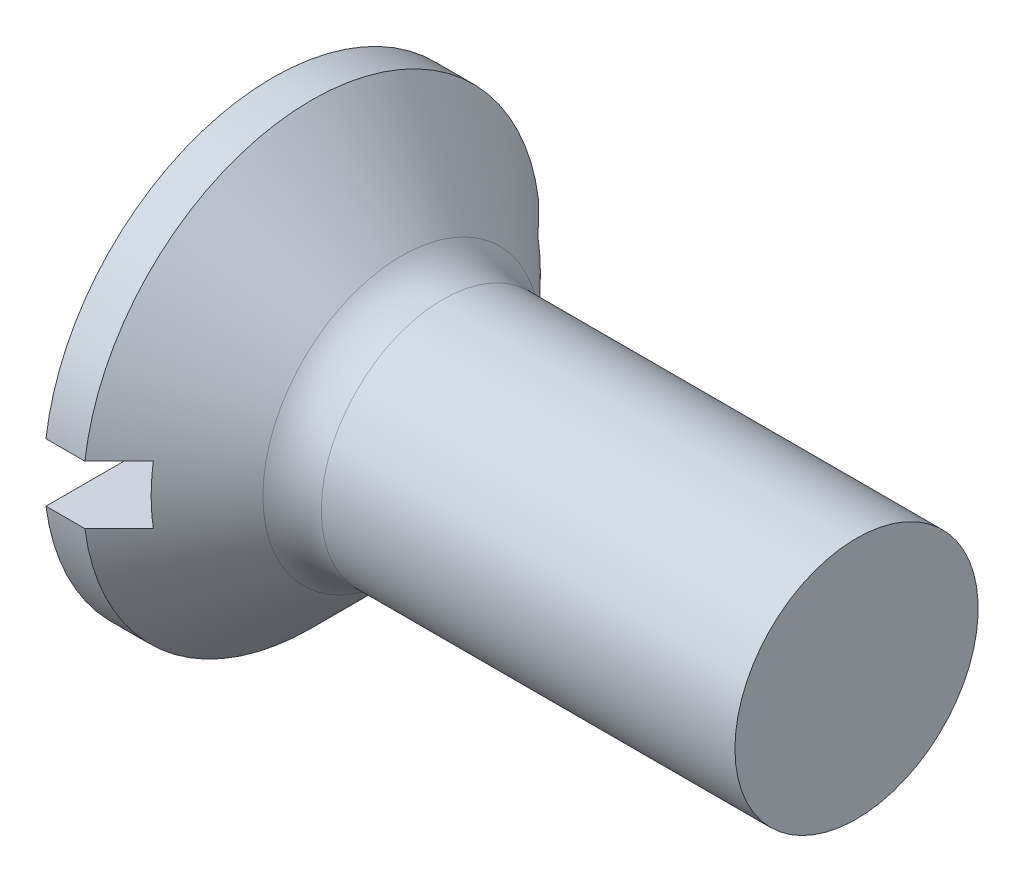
ISO-10303-21;
HEADER;
FILE_DESCRIPTION(('STEP AP214'),'2;1');
FILE_NAME('part.step','',(''),(''),'','','');
FILE_SCHEMA(('AUTOMOTIVE_DESIGN { 1 0 10303 214 1 1 1 1 }'));
ENDSEC;
DATA;
#1=APPLICATION_CONTEXT('core data for automotive mechanical design processes');
#2=APPLICATION_PROTOCOL_DEFINITION('international standard','automotive_design',2000,#1);
#3=PRODUCT_CONTEXT('',#1,'mechanical');
#4=PRODUCT('Part','Part','',(#3));
#5=PRODUCT_RELATED_PRODUCT_CATEGORY('part','',(#4));
#6=PRODUCT_DEFINITION_FORMATION('','',#4);
#7=PRODUCT_DEFINITION_CONTEXT('part definition',#1,'design');
#8=PRODUCT_DEFINITION('design','',#6,#7);
#9=PRODUCT_DEFINITION_SHAPE('','',#8);
#10=(LENGTH_UNIT() NAMED_UNIT(*) SI_UNIT(.MILLI.,.METRE.));
#11=(NAMED_UNIT(*) PLANE_ANGLE_UNIT() SI_UNIT($,.RADIAN.));
#12=(NAMED_UNIT(*) SI_UNIT($,.STERADIAN.) SOLID_ANGLE_UNIT());
#13=UNCERTAINTY_MEASURE_WITH_UNIT(LENGTH_MEASURE(1.E-05),#10,'distance_accuracy_value','');
#14=(GEOMETRIC_REPRESENTATION_CONTEXT(3) GLOBAL_UNCERTAINTY_ASSIGNED_CONTEXT((#13)) GLOBAL_UNIT_ASSIGNED_CONTEXT((#10,
#11,#12)) REPRESENTATION_CONTEXT('',''));
#15=CARTESIAN_POINT('',(0.,0.,0.));
#16=DIRECTION('',(0.,0.,1.));
#17=DIRECTION('',(1.,0.,0.));
#18=AXIS2_PLACEMENT_3D('',#15,#16,#17);
#19=CARTESIAN_POINT('',(0.,0.,0.));
#20=DIRECTION('',(-1.,0.,0.));
#21=DIRECTION('',(0.,0.,1.));
#22=AXIS2_PLACEMENT_3D('',#19,#20,#21);
#23=PLANE('',#22);
#24=DIRECTION('',(0.,0.,-1.));
#25=VECTOR('',#24,1.);
#26=CARTESIAN_POINT('',(0.,0.3,2.35));
#27=LINE('',#26,#25);
#28=CARTESIAN_POINT('',(0.,0.3,2.33077240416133));
#29=VERTEX_POINT('',#28);
#30=CARTESIAN_POINT('',(0.,0.3,-2.33077240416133));
#31=VERTEX_POINT('',#30);
#32=EDGE_CURVE('E167',#29,#31,#27,.T.);
#33=ORIENTED_EDGE('',*,*,#32,.F.);
#34=CARTESIAN_POINT('',(0.,0.,0.));
#35=DIRECTION('',(-1.,0.,0.));
#36=DIRECTION('',(0.,0.,1.));
#37=AXIS2_PLACEMENT_3D('',#34,#35,#36);
#38=CIRCLE('',#37,2.35);
#39=EDGE_CURVE('E109',#29,#31,#38,.T.);
#40=ORIENTED_EDGE('',*,*,#39,.T.);
#41=EDGE_LOOP('',(#33,#40));
#42=FACE_BOUND('',#41,.T.);
#43=ADVANCED_FACE('F28',(#42),#23,.T.);
#44=CARTESIAN_POINT('',(-6.34999999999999,0.,0.));
#45=DIRECTION('',(-1.,0.,0.));
#46=DIRECTION('',(0.,0.,1.));
#47=AXIS2_PLACEMENT_3D('',#44,#45,#46);
#48=CYLINDRICAL_SURFACE('',#47,2.35);
#49=DIRECTION('',(-1.,0.,0.));
#50=VECTOR('',#49,1.);
#51=CARTESIAN_POINT('',(-6.34999999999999,0.3,-2.33077240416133));
#52=LINE('',#51,#50);
#53=CARTESIAN_POINT('',(0.399999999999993,0.3,-2.33077240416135));
#54=VERTEX_POINT('',#53);
#55=EDGE_CURVE('E56',#31,#54,#52,.F.);
#56=ORIENTED_EDGE('',*,*,#55,.F.);
#57=ORIENTED_EDGE('',*,*,#39,.F.);
#58=DIRECTION('',(-1.,0.,0.));
#59=VECTOR('',#58,1.);
#60=CARTESIAN_POINT('',(-6.34999999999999,0.3,2.33077240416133));
#61=LINE('',#60,#59);
#62=CARTESIAN_POINT('',(0.400000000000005,0.3,2.33077240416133));
#63=VERTEX_POINT('',#62);
#64=EDGE_CURVE('E173',#63,#29,#61,.T.);
#65=ORIENTED_EDGE('',*,*,#64,.F.);
#66=CARTESIAN_POINT('',(0.400000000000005,0.,0.));
#67=DIRECTION('',(-1.,0.,0.));
#68=DIRECTION('',(0.,0.,1.));
#69=AXIS2_PLACEMENT_3D('',#66,#67,#68);
#70=CIRCLE('',#69,2.35);
#71=EDGE_CURVE('E103',#63,#54,#70,.T.);
#72=ORIENTED_EDGE('',*,*,#71,.T.);
#73=EDGE_LOOP('',(#56,#57,#65,#72));
#74=FACE_BOUND('',#73,.T.);
#75=ADVANCED_FACE('F152',(#74),#48,.T.);
#76=DIRECTION('',(0.,0.,1.));
#77=VECTOR('',#76,1.);
#78=CARTESIAN_POINT('',(0.,-0.300000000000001,-2.35));
#79=LINE('',#78,#77);
#80=CARTESIAN_POINT('',(0.,-0.300000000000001,-2.33077240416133));
#81=VERTEX_POINT('',#80);
#82=CARTESIAN_POINT('',(0.,-0.300000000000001,2.33077240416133));
#83=VERTEX_POINT('',#82);
#84=EDGE_CURVE('E97',#81,#83,#79,.T.);
#85=ORIENTED_EDGE('',*,*,#84,.F.);
#86=EDGE_CURVE('E105',#81,#83,#38,.T.);
#87=ORIENTED_EDGE('',*,*,#86,.T.);
#88=EDGE_LOOP('',(#85,#87));
#89=FACE_BOUND('',#88,.T.);
#90=ADVANCED_FACE('F30',(#89),#23,.T.);
#91=DIRECTION('',(-1.,0.,0.));
#92=VECTOR('',#91,1.);
#93=CARTESIAN_POINT('',(-6.34999999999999,-0.300000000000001,2.33077240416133));
#94=LINE('',#93,#92);
#95=CARTESIAN_POINT('',(0.399999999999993,-0.300000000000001,2.33077240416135));
#96=VERTEX_POINT('',#95);
#97=EDGE_CURVE('E172',#83,#96,#94,.F.);
#98=ORIENTED_EDGE('',*,*,#97,.F.);
#99=ORIENTED_EDGE('',*,*,#86,.F.);
#100=DIRECTION('',(-1.,0.,0.));
#101=VECTOR('',#100,1.);
#102=CARTESIAN_POINT('',(-6.34999999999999,-0.300000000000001,-2.33077240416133));
#103=LINE('',#102,#101);
#104=CARTESIAN_POINT('',(0.400000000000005,-0.300000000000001,-2.33077240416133));
#105=VERTEX_POINT('',#104);
#106=EDGE_CURVE('E170',#105,#81,#103,.T.);
#107=ORIENTED_EDGE('',*,*,#106,.F.);
#108=EDGE_CURVE('E106',#105,#96,#70,.T.);
#109=ORIENTED_EDGE('',*,*,#108,.T.);
#110=EDGE_LOOP('',(#98,#99,#107,#109));
#111=FACE_BOUND('',#110,.T.);
#112=ADVANCED_FACE('F149',(#111),#48,.T.);
#113=CARTESIAN_POINT('',(0.400000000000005,0.,0.));
#114=DIRECTION('',(-1.,0.,0.));
#115=DIRECTION('',(0.,0.,1.));
#116=AXIS2_PLACEMENT_3D('',#113,#114,#115);
#117=CONICAL_SURFACE('',#116,2.35,0.78539816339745);
#118=CARTESIAN_POINT('',(-2.42800833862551,0.299999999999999,-5.16931043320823));
#119=CARTESIAN_POINT('',(-2.25261841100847,0.299999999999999,-4.99362307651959));
#120=CARTESIAN_POINT('',(-2.07724133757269,0.299999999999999,-4.81792287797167));
#121=CARTESIAN_POINT('',(-1.72652707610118,0.299999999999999,-4.46647837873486));
#122=CARTESIAN_POINT('',(-1.55118988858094,0.299999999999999,-4.29073407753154));
#123=CARTESIAN_POINT('',(-1.20052586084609,0.299999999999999,-3.93913911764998));
#124=CARTESIAN_POINT('',(-1.02519903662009,0.299999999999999,-3.76328844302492));
#125=CARTESIAN_POINT('',(-0.674635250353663,0.299999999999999,-3.41150171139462));
#126=CARTESIAN_POINT('',(-0.499398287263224,0.299999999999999,-3.23556565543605));
#127=CARTESIAN_POINT('',(-0.14274224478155,0.3,-2.87719891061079));
#128=CARTESIAN_POINT('',(0.0386716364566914,0.3,-2.69476304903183));
#129=CARTESIAN_POINT('',(0.401243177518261,0.3,-2.32962368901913));
#130=CARTESIAN_POINT('',(0.582400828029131,0.3,-2.14692018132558));
#131=CARTESIAN_POINT('',(0.853701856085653,0.3,-1.87246633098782));
#132=CARTESIAN_POINT('',(0.944055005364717,0.3,-1.78092337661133));
#133=CARTESIAN_POINT('',(1.12454060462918,0.3,-1.59761714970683));
#134=CARTESIAN_POINT('',(1.21467305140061,0.3,-1.50585387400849));
#135=CARTESIAN_POINT('',(1.39455527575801,0.3,-1.32196522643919));
#136=CARTESIAN_POINT('',(1.48430507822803,0.3,-1.229839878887));
#137=CARTESIAN_POINT('',(1.66312457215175,0.3,-1.04493203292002));
#138=CARTESIAN_POINT('',(1.75219428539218,0.3,-0.952149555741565));
#139=CARTESIAN_POINT('',(1.86420471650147,0.3,-0.833484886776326));
#140=CARTESIAN_POINT('',(1.88787598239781,0.3,-0.808293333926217));
#141=CARTESIAN_POINT('',(1.93506265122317,0.3,-0.757763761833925));
#142=CARTESIAN_POINT('',(1.95857805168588,0.3,-0.732425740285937));
#143=CARTESIAN_POINT('',(2.00531964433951,0.3,-0.681650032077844));
#144=CARTESIAN_POINT('',(2.02854656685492,0.3,-0.656213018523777));
#145=CARTESIAN_POINT('',(2.07471756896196,0.3,-0.605084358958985));
#146=CARTESIAN_POINT('',(2.09766165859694,0.3,-0.579392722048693));
#147=CARTESIAN_POINT('',(2.15086468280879,0.3,-0.51888076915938));
#148=CARTESIAN_POINT('',(2.18096450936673,0.3,-0.48392043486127));
#149=CARTESIAN_POINT('',(2.24014710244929,0.3,-0.412740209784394));
#150=CARTESIAN_POINT('',(2.26922201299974,0.3,-0.376513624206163));
#151=CARTESIAN_POINT('',(2.31115781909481,0.3,-0.320521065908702));
#152=CARTESIAN_POINT('',(2.32494116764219,0.3,-0.301451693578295));
#153=CARTESIAN_POINT('',(2.35155128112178,0.3,-0.262609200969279));
#154=CARTESIAN_POINT('',(2.36437673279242,0.3,-0.242835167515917));
#155=CARTESIAN_POINT('',(2.38838369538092,0.3,-0.202548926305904));
#156=CARTESIAN_POINT('',(2.39957972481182,0.3,-0.182045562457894));
#157=CARTESIAN_POINT('',(2.41950326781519,0.3,-0.139898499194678));
#158=CARTESIAN_POINT('',(2.42823853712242,0.3,-0.118258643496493));
#159=CARTESIAN_POINT('',(2.44121464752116,0.3,-0.0756315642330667));
#160=CARTESIAN_POINT('',(2.44577820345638,0.3,-0.0547490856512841));
#161=CARTESIAN_POINT('',(2.45045814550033,0.3,-0.0125607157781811));
#162=CARTESIAN_POINT('',(2.45059819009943,0.3,0.00874231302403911));
#163=CARTESIAN_POINT('',(2.44645713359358,0.3,0.0507745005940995));
#164=CARTESIAN_POINT('',(2.44219645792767,0.3,0.0715058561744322));
#165=CARTESIAN_POINT('',(2.43034285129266,0.3,0.112088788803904));
#166=CARTESIAN_POINT('',(2.42272600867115,0.3,0.131932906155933));
#167=CARTESIAN_POINT('',(2.40627133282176,0.3,0.168480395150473));
#168=CARTESIAN_POINT('',(2.39765896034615,0.3,0.185289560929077));
#169=CARTESIAN_POINT('',(2.3792568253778,0.3,0.218258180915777));
#170=CARTESIAN_POINT('',(2.36946608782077,0.3,0.234417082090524));
#171=CARTESIAN_POINT('',(2.33884369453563,0.3,0.282238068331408));
#172=CARTESIAN_POINT('',(2.3168212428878,0.3,0.313127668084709));
#173=CARTESIAN_POINT('',(2.27098335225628,0.3,0.37396790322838));
#174=CARTESIAN_POINT('',(2.24715273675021,0.3,0.403906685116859));
#175=CARTESIAN_POINT('',(2.19860686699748,0.3,0.462939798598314));
#176=CARTESIAN_POINT('',(2.17389378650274,0.3,0.492035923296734));
#177=CARTESIAN_POINT('',(2.09996652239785,0.3,0.577366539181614));
#178=CARTESIAN_POINT('',(2.04995461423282,0.3,0.632904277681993));
#179=CARTESIAN_POINT('',(1.94893899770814,0.3,0.743075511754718));
#180=CARTESIAN_POINT('',(1.89793511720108,0.3,0.797708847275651));
#181=CARTESIAN_POINT('',(1.79530712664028,0.3,0.906513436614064));
#182=CARTESIAN_POINT('',(1.74368234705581,0.3,0.960684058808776));
#183=CARTESIAN_POINT('',(1.64009874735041,0.3,1.06869576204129));
#184=CARTESIAN_POINT('',(1.58813995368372,0.3,1.12253686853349));
#185=CARTESIAN_POINT('',(1.43299775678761,0.3,1.28265340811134));
#186=CARTESIAN_POINT('',(1.3294988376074,0.3,1.38862292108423));
#187=CARTESIAN_POINT('',(1.12213953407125,0.3,1.60010735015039));
#188=CARTESIAN_POINT('',(1.0182793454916,0.3,1.70562245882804));
#189=CARTESIAN_POINT('',(0.776938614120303,0.3,1.95025555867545));
#190=CARTESIAN_POINT('',(0.639369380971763,0.3,2.0892860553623));
#191=CARTESIAN_POINT('',(0.364008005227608,0.3,2.36712673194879));
#192=CARTESIAN_POINT('',(0.226215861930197,0.3,2.50593691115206));
#193=CARTESIAN_POINT('',(-0.187415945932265,0.3,2.92222808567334));
#194=CARTESIAN_POINT('',(-0.463453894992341,0.3,3.19951203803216));
#195=CARTESIAN_POINT('',(-1.02086601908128,0.3,3.7589880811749));
#196=CARTESIAN_POINT('',(-1.30224437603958,0.3,4.04117600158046));
#197=CARTESIAN_POINT('',(-1.86507745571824,0.3,4.60535323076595));
#198=CARTESIAN_POINT('',(-2.14653214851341,0.3,4.88734256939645));
#199=CARTESIAN_POINT('',(-2.42800833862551,0.3,5.16931043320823));
#200=B_SPLINE_CURVE_WITH_KNOTS('',3,(#118,#119,#120,#121,#122,#123,#124,#125,#126,#127,#128,
#129,#130,#131,#132,#133,#134,#135,#136,#137,#138,#139,#140,#141,#142,#143,#144,#145,#146,#147,
#148,#149,#150,#151,#152,#153,#154,#155,#156,#157,#158,#159,#160,#161,#162,#163,#164,#165,#166,
#167,#168,#169,#170,#171,#172,#173,#174,#175,#176,#177,#178,#179,#180,#181,#182,#183,#184,#185,
#186,#187,#188,#189,#190,#191,#192,#193,#194,#195,#196,#197,#198,#199),.UNSPECIFIED.,.F.,.F.,(4,
2,2,2,2,2,2,2,2,2,2,2,2,2,2,2,2,2,2,2,2,2,2,2,2,2,2,2,2,2,2,2,2,2,2,2,2,2,2,2,4),(0.,
0.744747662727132,1.48950445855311,2.23446524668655,2.97941712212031,3.75126198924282,
4.52313422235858,4.9090022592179,5.29487588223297,5.68072401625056,6.06655973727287,
6.17026308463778,6.27396806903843,6.37730491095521,6.48063807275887,6.61902727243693,
6.75831338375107,6.82888195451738,6.89954556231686,6.96953490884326,7.03930113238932,
7.10304879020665,7.16645544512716,7.22956912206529,7.29313992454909,7.34974016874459,
7.40638757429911,7.52007317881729,7.63484962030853,7.74936057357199,7.97354071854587,
8.19776012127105,8.42224800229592,8.64671831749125,9.09109579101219,9.53526148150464,
10.1220256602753,10.7087916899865,11.8825672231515,13.078073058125,14.2733188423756),.UNSPECIFIED.);
#201=CARTESIAN_POINT('',(0.75,0.3,1.97737199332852));
#202=VERTEX_POINT('',#201);
#203=EDGE_CURVE('E11',#202,#63,#200,.T.);
#204=ORIENTED_EDGE('',*,*,#203,.F.);
#205=CARTESIAN_POINT('',(0.75,0.,0.));
#206=DIRECTION('',(1.,0.,0.));
#207=DIRECTION('',(0.,0.,-1.));
#208=AXIS2_PLACEMENT_3D('',#205,#206,#207);
#209=CIRCLE('',#208,2.);
#210=CARTESIAN_POINT('',(0.75,-0.300000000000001,1.97737199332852));
#211=VERTEX_POINT('',#210);
#212=EDGE_CURVE('E85',#211,#202,#209,.F.);
#213=ORIENTED_EDGE('',*,*,#212,.F.);
#214=CARTESIAN_POINT('',(-2.42800833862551,-0.300000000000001,5.16931043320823));
#215=CARTESIAN_POINT('',(-2.25261841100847,-0.300000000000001,4.99362307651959));
#216=CARTESIAN_POINT('',(-2.07724133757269,-0.300000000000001,4.81792287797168));
#217=CARTESIAN_POINT('',(-1.72652707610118,-0.300000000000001,4.46647837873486));
#218=CARTESIAN_POINT('',(-1.55118988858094,-0.300000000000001,4.29073407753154));
#219=CARTESIAN_POINT('',(-1.20052586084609,-0.300000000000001,3.93913911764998));
#220=CARTESIAN_POINT('',(-1.02519903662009,-0.300000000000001,3.76328844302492));
#221=CARTESIAN_POINT('',(-0.674635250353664,-0.300000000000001,3.41150171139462));
#222=CARTESIAN_POINT('',(-0.499398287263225,-0.300000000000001,3.23556565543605));
#223=CARTESIAN_POINT('',(-0.142742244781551,-0.300000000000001,2.87719891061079));
#224=CARTESIAN_POINT('',(0.0386716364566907,-0.300000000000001,2.69476304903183));
#225=CARTESIAN_POINT('',(0.401243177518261,-0.300000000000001,2.32962368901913));
#226=CARTESIAN_POINT('',(0.58240082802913,-0.300000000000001,2.14692018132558));
#227=CARTESIAN_POINT('',(0.853701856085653,-0.300000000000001,1.87246633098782));
#228=CARTESIAN_POINT('',(0.944055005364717,-0.300000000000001,1.78092337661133));
#229=CARTESIAN_POINT('',(1.12454060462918,-0.300000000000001,1.59761714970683));
#230=CARTESIAN_POINT('',(1.21467305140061,-0.300000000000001,1.50585387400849));
#231=CARTESIAN_POINT('',(1.39455527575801,-0.300000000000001,1.32196522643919));
#232=CARTESIAN_POINT('',(1.48430507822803,-0.300000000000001,1.229839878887));
#233=CARTESIAN_POINT('',(1.66312457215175,-0.300000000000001,1.04493203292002));
#234=CARTESIAN_POINT('',(1.75219428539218,-0.300000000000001,0.952149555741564));
#235=CARTESIAN_POINT('',(1.86420471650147,-0.300000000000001,0.833484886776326));
#236=CARTESIAN_POINT('',(1.88787598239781,-0.300000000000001,0.808293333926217));
#237=CARTESIAN_POINT('',(1.93506265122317,-0.300000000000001,0.757763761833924));
#238=CARTESIAN_POINT('',(1.95857805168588,-0.300000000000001,0.732425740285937));
#239=CARTESIAN_POINT('',(2.00531964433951,-0.300000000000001,0.681650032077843));
#240=CARTESIAN_POINT('',(2.02854656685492,-0.300000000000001,0.656213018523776));
#241=CARTESIAN_POINT('',(2.07471756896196,-0.300000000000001,0.605084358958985));
#242=CARTESIAN_POINT('',(2.09766165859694,-0.300000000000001,0.579392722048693));
#243=CARTESIAN_POINT('',(2.15086468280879,-0.300000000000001,0.51888076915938));
#244=CARTESIAN_POINT('',(2.18096450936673,-0.300000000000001,0.48392043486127));
#245=CARTESIAN_POINT('',(2.24014710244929,-0.300000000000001,0.412740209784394));
#246=CARTESIAN_POINT('',(2.26922201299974,-0.300000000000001,0.376513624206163));
#247=CARTESIAN_POINT('',(2.31115781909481,-0.300000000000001,0.320521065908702));
#248=CARTESIAN_POINT('',(2.32494116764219,-0.300000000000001,0.301451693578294));
#249=CARTESIAN_POINT('',(2.35155128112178,-0.300000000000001,0.262609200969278));
#250=CARTESIAN_POINT('',(2.36437673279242,-0.300000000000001,0.242835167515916));
#251=CARTESIAN_POINT('',(2.38838369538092,-0.300000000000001,0.202548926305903));
#252=CARTESIAN_POINT('',(2.39957972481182,-0.300000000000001,0.182045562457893));
#253=CARTESIAN_POINT('',(2.41950326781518,-0.300000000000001,0.139898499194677));
#254=CARTESIAN_POINT('',(2.42823853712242,-0.300000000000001,0.118258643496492));
#255=CARTESIAN_POINT('',(2.44121464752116,-0.300000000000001,0.075631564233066));
#256=CARTESIAN_POINT('',(2.44577820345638,-0.300000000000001,0.0547490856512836));
#257=CARTESIAN_POINT('',(2.45045814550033,-0.300000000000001,0.0125607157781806));
#258=CARTESIAN_POINT('',(2.45059819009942,-0.300000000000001,-0.00874231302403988));
#259=CARTESIAN_POINT('',(2.44645713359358,-0.300000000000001,-0.0507745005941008));
#260=CARTESIAN_POINT('',(2.44219645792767,-0.300000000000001,-0.0715058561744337));
#261=CARTESIAN_POINT('',(2.43034285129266,-0.300000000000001,-0.112088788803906));
#262=CARTESIAN_POINT('',(2.42272600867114,-0.300000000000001,-0.131932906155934));
#263=CARTESIAN_POINT('',(2.40627133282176,-0.300000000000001,-0.168480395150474));
#264=CARTESIAN_POINT('',(2.39765896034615,-0.300000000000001,-0.185289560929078));
#265=CARTESIAN_POINT('',(2.3792568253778,-0.300000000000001,-0.21825818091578));
#266=CARTESIAN_POINT('',(2.36946608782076,-0.300000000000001,-0.234417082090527));
#267=CARTESIAN_POINT('',(2.33884369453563,-0.300000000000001,-0.28223806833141));
#268=CARTESIAN_POINT('',(2.3168212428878,-0.300000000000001,-0.313127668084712));
#269=CARTESIAN_POINT('',(2.27098335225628,-0.300000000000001,-0.373967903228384));
#270=CARTESIAN_POINT('',(2.2471527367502,-0.300000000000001,-0.403906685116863));
#271=CARTESIAN_POINT('',(2.19860686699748,-0.300000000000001,-0.462939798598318));
#272=CARTESIAN_POINT('',(2.17389378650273,-0.300000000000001,-0.492035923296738));
#273=CARTESIAN_POINT('',(2.09996652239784,-0.300000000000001,-0.577366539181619));
#274=CARTESIAN_POINT('',(2.04995461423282,-0.300000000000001,-0.632904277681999));
#275=CARTESIAN_POINT('',(1.94893899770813,-0.300000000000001,-0.743075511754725));
#276=CARTESIAN_POINT('',(1.89793511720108,-0.300000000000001,-0.797708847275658));
#277=CARTESIAN_POINT('',(1.79530712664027,-0.300000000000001,-0.906513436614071));
#278=CARTESIAN_POINT('',(1.74368234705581,-0.300000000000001,-0.960684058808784));
#279=CARTESIAN_POINT('',(1.64009874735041,-0.300000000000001,-1.0686957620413));
#280=CARTESIAN_POINT('',(1.58813995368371,-0.300000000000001,-1.1225368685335));
#281=CARTESIAN_POINT('',(1.4329977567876,-0.300000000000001,-1.28265340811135));
#282=CARTESIAN_POINT('',(1.32949883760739,-0.300000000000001,-1.38862292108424));
#283=CARTESIAN_POINT('',(1.12213953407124,-0.300000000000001,-1.60010735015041));
#284=CARTESIAN_POINT('',(1.01827934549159,-0.300000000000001,-1.70562245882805));
#285=CARTESIAN_POINT('',(0.776938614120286,-0.300000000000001,-1.95025555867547));
#286=CARTESIAN_POINT('',(0.639369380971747,-0.300000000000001,-2.08928605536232));
#287=CARTESIAN_POINT('',(0.364008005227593,-0.300000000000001,-2.36712673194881));
#288=CARTESIAN_POINT('',(0.226215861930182,-0.300000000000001,-2.50593691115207));
#289=CARTESIAN_POINT('',(-0.187415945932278,-0.300000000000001,-2.92222808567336));
#290=CARTESIAN_POINT('',(-0.463453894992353,-0.300000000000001,-3.19951203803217));
#291=CARTESIAN_POINT('',(-1.02086601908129,-0.300000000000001,-3.75898808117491));
#292=CARTESIAN_POINT('',(-1.30224437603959,-0.300000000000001,-4.04117600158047));
#293=CARTESIAN_POINT('',(-1.86507745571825,-0.300000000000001,-4.60535323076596));
#294=CARTESIAN_POINT('',(-2.14653214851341,-0.300000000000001,-4.88734256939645));
#295=CARTESIAN_POINT('',(-2.42800833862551,-0.300000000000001,-5.16931043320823));
#296=B_SPLINE_CURVE_WITH_KNOTS('',3,(#214,#215,#216,#217,#218,#219,#220,#221,#222,#223,#224,
#225,#226,#227,#228,#229,#230,#231,#232,#233,#234,#235,#236,#237,#238,#239,#240,#241,#242,#243,
#244,#245,#246,#247,#248,#249,#250,#251,#252,#253,#254,#255,#256,#257,#258,#259,#260,#261,#262,
#263,#264,#265,#266,#267,#268,#269,#270,#271,#272,#273,#274,#275,#276,#277,#278,#279,#280,#281,
#282,#283,#284,#285,#286,#287,#288,#289,#290,#291,#292,#293,#294,#295),.UNSPECIFIED.,.F.,.F.,(4,
2,2,2,2,2,2,2,2,2,2,2,2,2,2,2,2,2,2,2,2,2,2,2,2,2,2,2,2,2,2,2,2,2,2,2,2,2,2,2,4),(0.,
0.744747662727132,1.48950445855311,2.23446524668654,2.97941712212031,3.75126198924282,
4.52313422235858,4.9090022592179,5.29487588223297,5.68072401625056,6.06655973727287,
6.17026308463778,6.27396806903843,6.37730491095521,6.48063807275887,6.61902727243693,
6.75831338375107,6.82888195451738,6.89954556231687,6.96953490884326,7.03930113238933,
7.10304879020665,7.16645544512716,7.22956912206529,7.29313992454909,7.3497401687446,
7.40638757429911,7.5200731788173,7.63484962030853,7.74936057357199,7.97354071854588,
8.19776012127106,8.42224800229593,8.64671831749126,9.0910957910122,9.53526148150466,
10.1220256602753,10.7087916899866,11.8825672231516,13.078073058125,14.2733188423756),.UNSPECIFIED.);
#297=EDGE_CURVE('E42',#96,#211,#296,.T.);
#298=ORIENTED_EDGE('',*,*,#297,.F.);
#299=ORIENTED_EDGE('',*,*,#108,.F.);
#300=CARTESIAN_POINT('',(0.75,-0.300000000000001,-1.97737199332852));
#301=VERTEX_POINT('',#300);
#302=EDGE_CURVE('E121',#301,#105,#296,.T.);
#303=ORIENTED_EDGE('',*,*,#302,.F.);
#304=CARTESIAN_POINT('',(0.75,0.3,-1.97737199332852));
#305=VERTEX_POINT('',#304);
#306=EDGE_CURVE('E93',#305,#301,#209,.F.);
#307=ORIENTED_EDGE('',*,*,#306,.F.);
#308=EDGE_CURVE('E32',#54,#305,#200,.T.);
#309=ORIENTED_EDGE('',*,*,#308,.F.);
#310=ORIENTED_EDGE('',*,*,#71,.F.);
#311=EDGE_LOOP('',(#204,#213,#298,#299,#303,#307,#309,#310));
#312=FACE_BOUND('',#311,.T.);
#313=CARTESIAN_POINT('',(1.32426406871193,0.,0.));
#314=DIRECTION('',(-1.,0.,0.));
#315=DIRECTION('',(0.,0.,1.));
#316=AXIS2_PLACEMENT_3D('',#313,#314,#315);
#317=CIRCLE('',#316,1.42573593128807);
#318=CARTESIAN_POINT('',(1.32426406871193,0.,1.42573593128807));
#319=VERTEX_POINT('',#318);
#320=EDGE_CURVE('E116',#319,#319,#317,.T.);
#321=ORIENTED_EDGE('',*,*,#320,.T.);
#322=EDGE_LOOP('',(#321));
#323=FACE_BOUND('',#322,.T.);
#324=ADVANCED_FACE('F100',(#312,#323),#117,.T.);
#325=CARTESIAN_POINT('',(-6.34999999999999,0.,0.));
#326=DIRECTION('',(-1.,0.,0.));
#327=DIRECTION('',(0.,0.,1.));
#328=AXIS2_PLACEMENT_3D('',#325,#326,#327);
#329=CYLINDRICAL_SURFACE('',#328,1.25);
#330=CARTESIAN_POINT('',(1.74852813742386,0.,0.));
#331=DIRECTION('',(-1.,0.,0.));
#332=DIRECTION('',(0.,0.,1.));
#333=AXIS2_PLACEMENT_3D('',#330,#331,#332);
#334=CIRCLE('',#333,1.25);
#335=CARTESIAN_POINT('',(1.74852813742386,0.,1.25));
#336=VERTEX_POINT('',#335);
#337=EDGE_CURVE('E119',#336,#336,#334,.F.);
#338=ORIENTED_EDGE('',*,*,#337,.T.);
#339=EDGE_LOOP('',(#338));
#340=FACE_BOUND('',#339,.T.);
#341=CARTESIAN_POINT('',(6.,0.,0.));
#342=DIRECTION('',(-1.,0.,0.));
#343=DIRECTION('',(0.,0.,1.));
#344=AXIS2_PLACEMENT_3D('',#341,#342,#343);
#345=CIRCLE('',#344,1.25);
#346=CARTESIAN_POINT('',(6.,0.,1.25));
#347=VERTEX_POINT('',#346);
#348=EDGE_CURVE('E112',#347,#347,#345,.T.);
#349=ORIENTED_EDGE('',*,*,#348,.T.);
#350=EDGE_LOOP('',(#349));
#351=FACE_BOUND('',#350,.T.);
#352=ADVANCED_FACE('F142',(#340,#351),#329,.T.);
#353=CARTESIAN_POINT('',(6.,1.25,0.));
#354=DIRECTION('',(1.,0.,0.));
#355=DIRECTION('',(0.,0.,-1.));
#356=AXIS2_PLACEMENT_3D('',#353,#354,#355);
#357=PLANE('',#356);
#358=ORIENTED_EDGE('',*,*,#348,.F.);
#359=EDGE_LOOP('',(#358));
#360=FACE_BOUND('',#359,.T.);
#361=ADVANCED_FACE('F139',(#360),#357,.T.);
#362=CARTESIAN_POINT('',(1.74852813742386,0.,0.));
#363=DIRECTION('',(-1.,0.,0.));
#364=DIRECTION('',(0.,0.,1.));
#365=AXIS2_PLACEMENT_3D('',#362,#363,#364);
#366=TOROIDAL_SURFACE('',#365,1.85,0.6);
#367=ORIENTED_EDGE('',*,*,#337,.F.);
#368=EDGE_LOOP('',(#367));
#369=FACE_BOUND('',#368,.T.);
#370=ORIENTED_EDGE('',*,*,#320,.F.);
#371=EDGE_LOOP('',(#370));
#372=FACE_BOUND('',#371,.T.);
#373=ADVANCED_FACE('F136',(#369,#372),#366,.F.);
#374=CARTESIAN_POINT('',(0.75,0.3,2.35));
#375=DIRECTION('',(0.,1.,0.));
#376=DIRECTION('',(0.,0.,1.));
#377=AXIS2_PLACEMENT_3D('',#374,#375,#376);
#378=PLANE('',#377);
#379=ORIENTED_EDGE('',*,*,#55,.T.);
#380=ORIENTED_EDGE('',*,*,#308,.T.);
#381=DIRECTION('',(0.,0.,-1.));
#382=VECTOR('',#381,1.);
#383=CARTESIAN_POINT('',(0.75,0.3,2.35));
#384=LINE('',#383,#382);
#385=EDGE_CURVE('E49',#202,#305,#384,.T.);
#386=ORIENTED_EDGE('',*,*,#385,.F.);
#387=ORIENTED_EDGE('',*,*,#203,.T.);
#388=ORIENTED_EDGE('',*,*,#64,.T.);
#389=ORIENTED_EDGE('',*,*,#32,.T.);
#390=EDGE_LOOP('',(#379,#380,#386,#387,#388,#389));
#391=FACE_BOUND('',#390,.T.);
#392=ADVANCED_FACE('F94',(#391),#378,.F.);
#393=CARTESIAN_POINT('',(0.75,-0.300000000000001,-2.35));
#394=DIRECTION('',(0.,-1.,0.));
#395=DIRECTION('',(0.,0.,-1.));
#396=AXIS2_PLACEMENT_3D('',#393,#394,#395);
#397=PLANE('',#396);
#398=ORIENTED_EDGE('',*,*,#97,.T.);
#399=ORIENTED_EDGE('',*,*,#297,.T.);
#400=DIRECTION('',(0.,0.,1.));
#401=VECTOR('',#400,1.);
#402=CARTESIAN_POINT('',(0.75,-0.300000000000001,-2.35));
#403=LINE('',#402,#401);
#404=EDGE_CURVE('E88',#301,#211,#403,.T.);
#405=ORIENTED_EDGE('',*,*,#404,.F.);
#406=ORIENTED_EDGE('',*,*,#302,.T.);
#407=ORIENTED_EDGE('',*,*,#106,.T.);
#408=ORIENTED_EDGE('',*,*,#84,.T.);
#409=EDGE_LOOP('',(#398,#399,#405,#406,#407,#408));
#410=FACE_BOUND('',#409,.T.);
#411=ADVANCED_FACE('F128',(#410),#397,.F.);
#412=CARTESIAN_POINT('',(0.75,-0.300000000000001,-2.35));
#413=DIRECTION('',(1.,0.,0.));
#414=DIRECTION('',(0.,0.,-1.));
#415=AXIS2_PLACEMENT_3D('',#412,#413,#414);
#416=PLANE('',#415);
#417=ORIENTED_EDGE('',*,*,#212,.T.);
#418=ORIENTED_EDGE('',*,*,#385,.T.);
#419=ORIENTED_EDGE('',*,*,#306,.T.);
#420=ORIENTED_EDGE('',*,*,#404,.T.);
#421=EDGE_LOOP('',(#417,#418,#419,#420));
#422=FACE_BOUND('',#421,.T.);
#423=ADVANCED_FACE('F86',(#422),#416,.F.);
#424=CLOSED_SHELL('',(#43,#75,#90,#112,#324,#352,#361,#373,#392,#411,#423));
#425=MANIFOLD_SOLID_BREP('B2',#424);
#426=ADVANCED_BREP_SHAPE_REPRESENTATION('',(#18,#425),#14);
#427=SHAPE_DEFINITION_REPRESENTATION(#9,#426);
ENDSEC;
END-ISO-10303-21;
